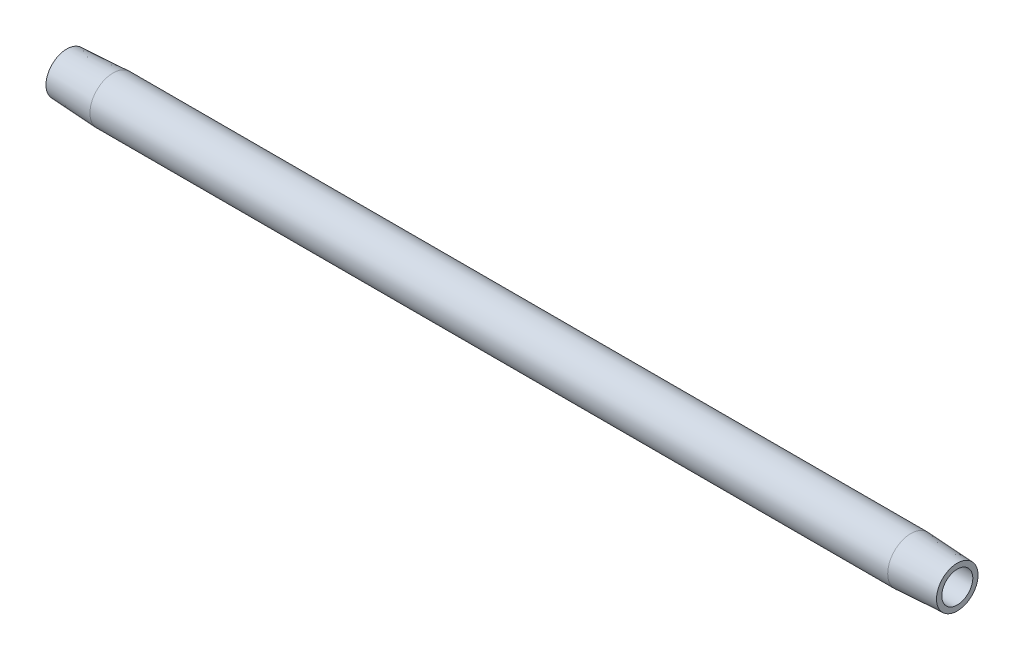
ISO-10303-21;
HEADER;
FILE_DESCRIPTION(('STEP AP214'),'2;1');
FILE_NAME('part.step','',(''),(''),'','','');
FILE_SCHEMA(('AUTOMOTIVE_DESIGN { 1 0 10303 214 1 1 1 1 }'));
ENDSEC;
DATA;
#1=APPLICATION_CONTEXT('core data for automotive mechanical design processes');
#2=APPLICATION_PROTOCOL_DEFINITION('international standard','automotive_design',2000,#1);
#3=PRODUCT_CONTEXT('',#1,'mechanical');
#4=PRODUCT('Part','Part','',(#3));
#5=PRODUCT_RELATED_PRODUCT_CATEGORY('part','',(#4));
#6=PRODUCT_DEFINITION_FORMATION('','',#4);
#7=PRODUCT_DEFINITION_CONTEXT('part definition',#1,'design');
#8=PRODUCT_DEFINITION('design','',#6,#7);
#9=PRODUCT_DEFINITION_SHAPE('','',#8);
#10=(LENGTH_UNIT() NAMED_UNIT(*) SI_UNIT(.MILLI.,.METRE.));
#11=(NAMED_UNIT(*) PLANE_ANGLE_UNIT() SI_UNIT($,.RADIAN.));
#12=(NAMED_UNIT(*) SI_UNIT($,.STERADIAN.) SOLID_ANGLE_UNIT());
#13=UNCERTAINTY_MEASURE_WITH_UNIT(LENGTH_MEASURE(1.E-05),#10,'distance_accuracy_value','');
#14=(GEOMETRIC_REPRESENTATION_CONTEXT(3) GLOBAL_UNCERTAINTY_ASSIGNED_CONTEXT((#13)) GLOBAL_UNIT_ASSIGNED_CONTEXT((#10,
#11,#12)) REPRESENTATION_CONTEXT('',''));
#15=CARTESIAN_POINT('',(0.,0.,0.));
#16=DIRECTION('',(0.,0.,1.));
#17=DIRECTION('',(1.,0.,0.));
#18=AXIS2_PLACEMENT_3D('',#15,#16,#17);
#19=CARTESIAN_POINT('',(0.476141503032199,0.,0.));
#20=DIRECTION('',(-1.,0.,0.));
#21=DIRECTION('',(0.,0.,1.));
#22=AXIS2_PLACEMENT_3D('',#19,#20,#21);
#23=CYLINDRICAL_SURFACE('',#22,3.96875);
#24=CARTESIAN_POINT('',(7.9375,0.,0.));
#25=DIRECTION('',(-1.,0.,0.));
#26=DIRECTION('',(0.,0.,1.));
#27=AXIS2_PLACEMENT_3D('',#24,#25,#26);
#28=CIRCLE('',#27,3.96875);
#29=CARTESIAN_POINT('',(7.9375,0.,3.96875));
#30=VERTEX_POINT('',#29);
#31=EDGE_CURVE('E10',#30,#30,#28,.T.);
#32=ORIENTED_EDGE('',*,*,#31,.F.);
#33=EDGE_LOOP('',(#32));
#34=FACE_BOUND('',#33,.T.);
#35=CARTESIAN_POINT('',(144.4625,0.,0.));
#36=DIRECTION('',(-1.,0.,0.));
#37=DIRECTION('',(0.,0.,1.));
#38=AXIS2_PLACEMENT_3D('',#35,#36,#37);
#39=CIRCLE('',#38,3.96875);
#40=CARTESIAN_POINT('',(144.4625,0.,3.96875));
#41=VERTEX_POINT('',#40);
#42=EDGE_CURVE('E52',#41,#41,#39,.T.);
#43=ORIENTED_EDGE('',*,*,#42,.T.);
#44=EDGE_LOOP('',(#43));
#45=FACE_BOUND('',#44,.T.);
#46=ADVANCED_FACE('F30',(#34,#45),#23,.T.);
#47=CARTESIAN_POINT('',(7.9375,0.,0.));
#48=DIRECTION('',(1.,0.,0.));
#49=DIRECTION('',(0.,0.,-1.));
#50=AXIS2_PLACEMENT_3D('',#47,#48,#49);
#51=CONICAL_SURFACE('',#50,3.96875,0.0523598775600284);
#52=CARTESIAN_POINT('',(0.,0.,0.));
#53=DIRECTION('',(-1.,0.,0.));
#54=DIRECTION('',(0.,0.,1.));
#55=AXIS2_PLACEMENT_3D('',#52,#53,#54);
#56=CIRCLE('',#55,3.55276325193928);
#57=CARTESIAN_POINT('',(0.,0.,3.55276325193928));
#58=VERTEX_POINT('',#57);
#59=EDGE_CURVE('E36',#58,#58,#56,.T.);
#60=ORIENTED_EDGE('',*,*,#59,.F.);
#61=EDGE_LOOP('',(#60));
#62=FACE_BOUND('',#61,.T.);
#63=ORIENTED_EDGE('',*,*,#31,.T.);
#64=EDGE_LOOP('',(#63));
#65=FACE_BOUND('',#64,.T.);
#66=ADVANCED_FACE('F77',(#62,#65),#51,.T.);
#67=CARTESIAN_POINT('',(0.,3.55276325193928,0.));
#68=DIRECTION('',(1.,0.,0.));
#69=DIRECTION('',(0.,0.,-1.));
#70=AXIS2_PLACEMENT_3D('',#67,#68,#69);
#71=PLANE('',#70);
#72=CARTESIAN_POINT('',(0.,0.,0.));
#73=DIRECTION('',(-1.,0.,0.));
#74=DIRECTION('',(0.,0.,1.));
#75=AXIS2_PLACEMENT_3D('',#72,#73,#74);
#76=CIRCLE('',#75,2.65429999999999);
#77=CARTESIAN_POINT('',(0.,0.,2.65429999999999));
#78=VERTEX_POINT('',#77);
#79=EDGE_CURVE('E40',#78,#78,#76,.T.);
#80=ORIENTED_EDGE('',*,*,#79,.F.);
#81=EDGE_LOOP('',(#80));
#82=FACE_BOUND('',#81,.T.);
#83=ORIENTED_EDGE('',*,*,#59,.T.);
#84=EDGE_LOOP('',(#83));
#85=FACE_BOUND('',#84,.T.);
#86=ADVANCED_FACE('F72',(#82,#85),#71,.F.);
#87=CARTESIAN_POINT('',(0.476141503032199,0.,0.));
#88=DIRECTION('',(-1.,0.,0.));
#89=DIRECTION('',(0.,0.,1.));
#90=AXIS2_PLACEMENT_3D('',#87,#88,#89);
#91=CYLINDRICAL_SURFACE('',#90,2.6543);
#92=CARTESIAN_POINT('',(152.4,0.,0.));
#93=DIRECTION('',(-1.,0.,0.));
#94=DIRECTION('',(0.,0.,1.));
#95=AXIS2_PLACEMENT_3D('',#92,#93,#94);
#96=CIRCLE('',#95,2.6543);
#97=CARTESIAN_POINT('',(152.4,0.,2.6543));
#98=VERTEX_POINT('',#97);
#99=EDGE_CURVE('E44',#98,#98,#96,.T.);
#100=ORIENTED_EDGE('',*,*,#99,.F.);
#101=EDGE_LOOP('',(#100));
#102=FACE_BOUND('',#101,.T.);
#103=ORIENTED_EDGE('',*,*,#79,.T.);
#104=EDGE_LOOP('',(#103));
#105=FACE_BOUND('',#104,.T.);
#106=ADVANCED_FACE('F66',(#102,#105),#91,.F.);
#107=CARTESIAN_POINT('',(152.4,2.6543,0.));
#108=DIRECTION('',(-1.,0.,0.));
#109=DIRECTION('',(0.,0.,1.));
#110=AXIS2_PLACEMENT_3D('',#107,#108,#109);
#111=PLANE('',#110);
#112=CARTESIAN_POINT('',(152.4,0.,0.));
#113=DIRECTION('',(-1.,0.,0.));
#114=DIRECTION('',(0.,0.,1.));
#115=AXIS2_PLACEMENT_3D('',#112,#113,#114);
#116=CIRCLE('',#115,3.55276325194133);
#117=CARTESIAN_POINT('',(152.4,0.,3.55276325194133));
#118=VERTEX_POINT('',#117);
#119=EDGE_CURVE('E49',#118,#118,#116,.T.);
#120=ORIENTED_EDGE('',*,*,#119,.F.);
#121=EDGE_LOOP('',(#120));
#122=FACE_BOUND('',#121,.T.);
#123=ORIENTED_EDGE('',*,*,#99,.T.);
#124=EDGE_LOOP('',(#123));
#125=FACE_BOUND('',#124,.T.);
#126=ADVANCED_FACE('F60',(#122,#125),#111,.F.);
#127=CARTESIAN_POINT('',(152.4,0.,0.));
#128=DIRECTION('',(-1.,0.,0.));
#129=DIRECTION('',(0.,0.,1.));
#130=AXIS2_PLACEMENT_3D('',#127,#128,#129);
#131=CONICAL_SURFACE('',#130,3.55276325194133,0.0523598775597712);
#132=ORIENTED_EDGE('',*,*,#42,.F.);
#133=EDGE_LOOP('',(#132));
#134=FACE_BOUND('',#133,.T.);
#135=ORIENTED_EDGE('',*,*,#119,.T.);
#136=EDGE_LOOP('',(#135));
#137=FACE_BOUND('',#136,.T.);
#138=ADVANCED_FACE('F57',(#134,#137),#131,.T.);
#139=CLOSED_SHELL('',(#46,#66,#86,#106,#126,#138));
#140=MANIFOLD_SOLID_BREP('B2',#139);
#141=ADVANCED_BREP_SHAPE_REPRESENTATION('',(#18,#140),#14);
#142=SHAPE_DEFINITION_REPRESENTATION(#9,#141);
ENDSEC;
END-ISO-10303-21;
